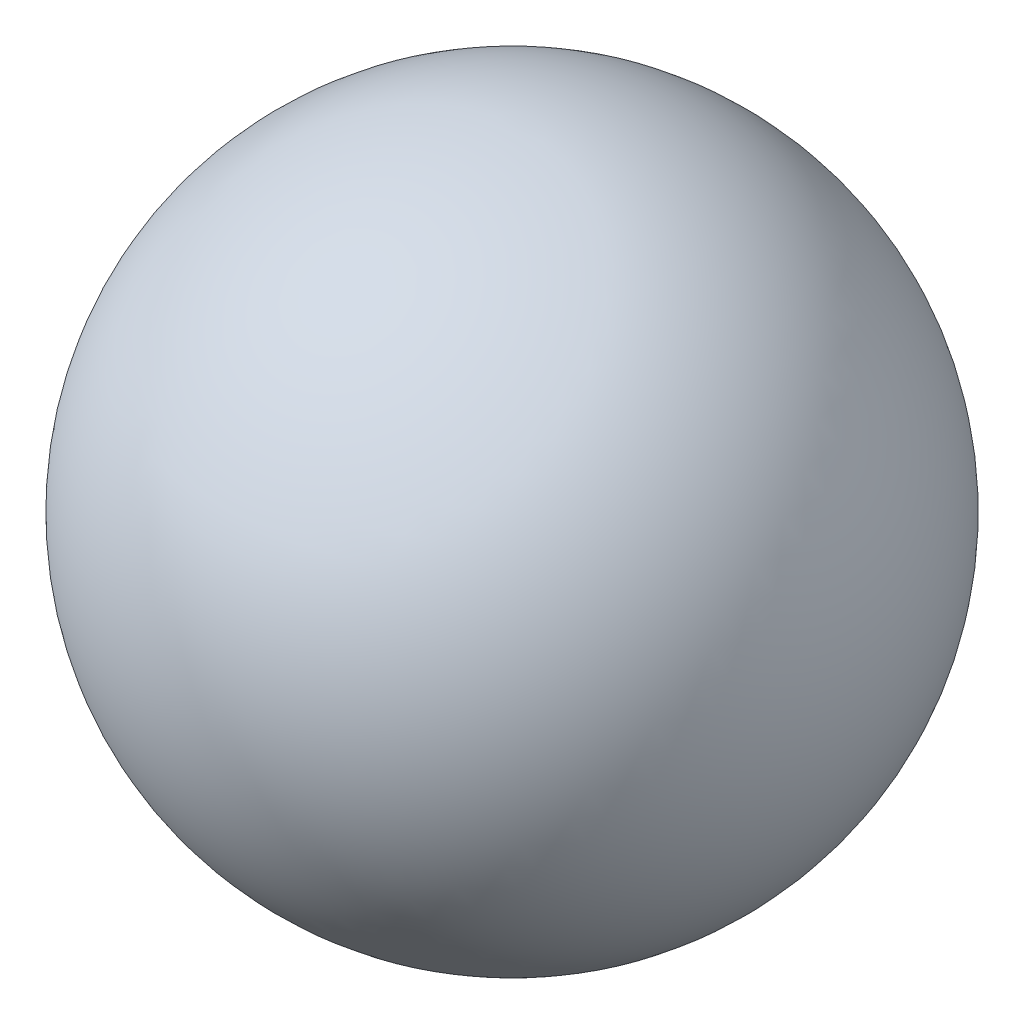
from build123d import *


with BuildPart() as part:
    # Sketch1 → Revolve1 (revolve)
    with BuildSketch(Plane.XY):
        with BuildLine():
            Line((0, 0.35), (0, -0.35))
            ThreePointArc((0, -0.35), (-0.35, 0), (0, 0.35))
        make_face()
    revolve(axis=Axis((0, 0.35, 0), (0, -1, 0)))


solid = part.part
